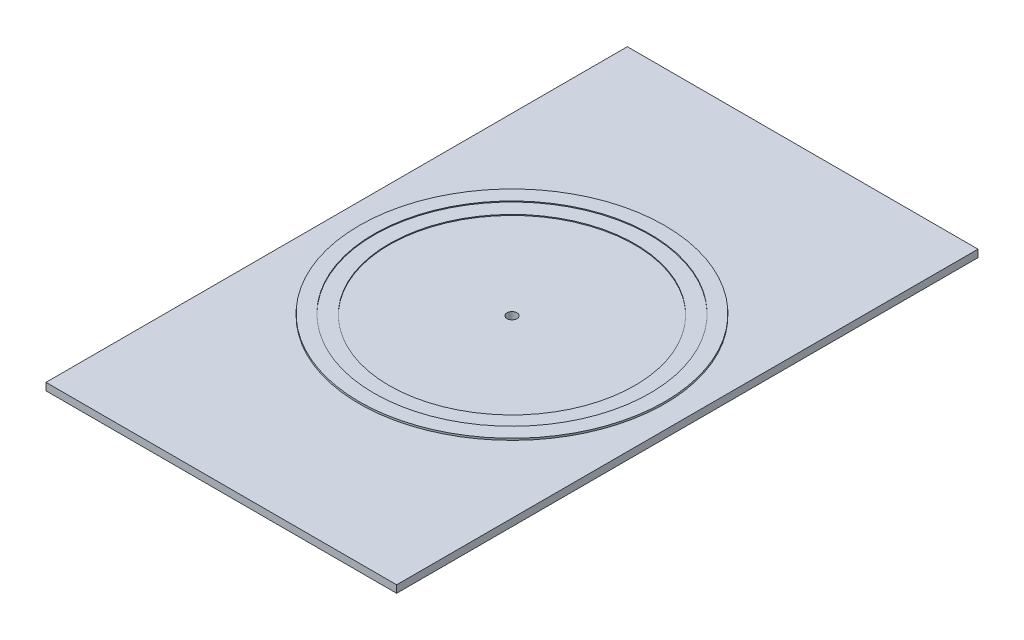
from build123d import *

# Parameters (mm, degrees)
SKETCH1_W           = 190
SKETCH1_H           = 315
SKETCH1_R           = 2.75
BOSS_EXTRUDE1_DEPTH = 4
SKETCH2_R           = 82.725
SKETCH2_R_2         = 74.765
BOSS_EXTRUDE2_DEPTH = 1
SKETCH3_R           = 74.765
SKETCH3_R_2         = 66.555
BOSS_EXTRUDE3_DEPTH = 0.5
SKETCH4_R           = 1
CUT_EXTRUDE1_DEPTH  = 2


with BuildPart() as part:
    # Sketch1 → Boss-Extrude1 (new body)
    with BuildSketch(Plane(origin=(0, 0, 0), x_dir=(1, 0, 0), z_dir=(0, 1, 0))):
        Rectangle(SKETCH1_W, SKETCH1_H)
        with Locations(Location((0, 0, 0), (0, 0, 270))):
            Circle(SKETCH1_R, mode=Mode.SUBTRACT)
    extrude(amount=BOSS_EXTRUDE1_DEPTH)

    # Sketch2 → Boss-Extrude2 (add)
    with BuildSketch(Plane(origin=(0, 4, 0), x_dir=(1, 0, 0), z_dir=(0, 1, 0))):
        with Locations(Location((0, 0, 0), (0, 0, 90))):
            Circle(SKETCH2_R)
        with Locations(Location((0, 0, 0), (0, 0, 270))):
            Circle(SKETCH2_R_2, mode=Mode.SUBTRACT)
    extrude(amount=BOSS_EXTRUDE2_DEPTH)

    # Sketch3 → Boss-Extrude3 (add)
    with BuildSketch(Plane(origin=(0, 4, 0), x_dir=(1, 0, 0), z_dir=(0, 1, 0))):
        with Locations(Location((0, 0, 0), (0, 0, 270))):
            Circle(SKETCH3_R)
        with Locations(Location((0, 0, 0), (0, 0, 270))):
            Circle(SKETCH3_R_2, mode=Mode.SUBTRACT)
    extrude(amount=BOSS_EXTRUDE3_DEPTH)

    # Sketch4 → Cut-Extrude1 (cut)
    with BuildSketch(Plane.XZ):
        with Locations(Location((-93, 155.5, 0), (0, 0, 270))):
            Circle(SKETCH4_R)
        with Locations(Location((0, 155.5, 0), (0, 0, 270))):
            Circle(SKETCH4_R)
        with Locations(Location((93, 155.5, 0), (0, 0, 270))):
            Circle(SKETCH4_R)
        with Locations(Location((93, 0, 0), (0, 0, 270))):
            Circle(SKETCH4_R)
        with Locations(Location((93, -155.5, 0), (0, 0, 270))):
            Circle(SKETCH4_R)
        with Locations(Location((0, -155.5, 0), (0, 0, 270))):
            Circle(SKETCH4_R)
        with Locations(Location((-93, -155.5, 0), (0, 0, 270))):
            Circle(SKETCH4_R)
        with Locations(Location((-93, 7.5, 0), (0, 0, 270))):
            Circle(SKETCH4_R)
        with Locations(Location((-93, -7.5, 0), (0, 0, 270))):
            Circle(SKETCH4_R)
    extrude(amount=-CUT_EXTRUDE1_DEPTH, mode=Mode.SUBTRACT)


solid = part.part
